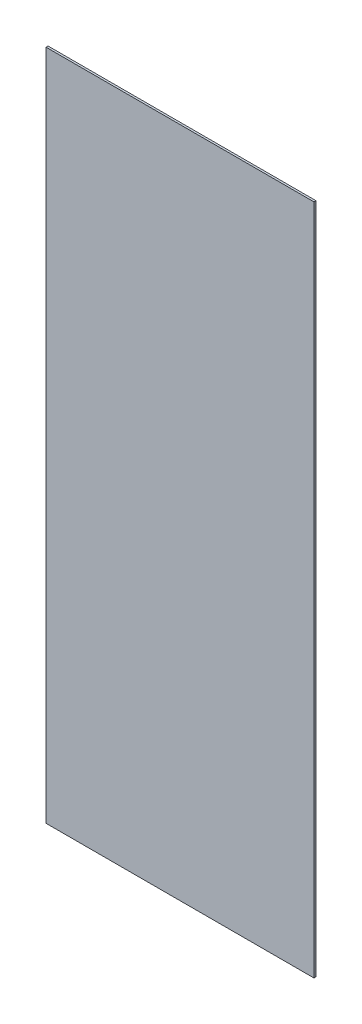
from build123d import *

# Parameters (mm, degrees)
ESBO_O1_W                = 790
ESBO_O1_H                = 1982
RESSALTO_EXTRUS_O1_DEPTH = 6


with BuildPart() as part:
    # Esbo_o1 → Ressalto-extrus_o1 (new body)
    with BuildSketch(Plane.XY):
        with Locations((0, 1009)):
            Rectangle(ESBO_O1_W, ESBO_O1_H)
    extrude(amount=-RESSALTO_EXTRUS_O1_DEPTH)


solid = part.part
